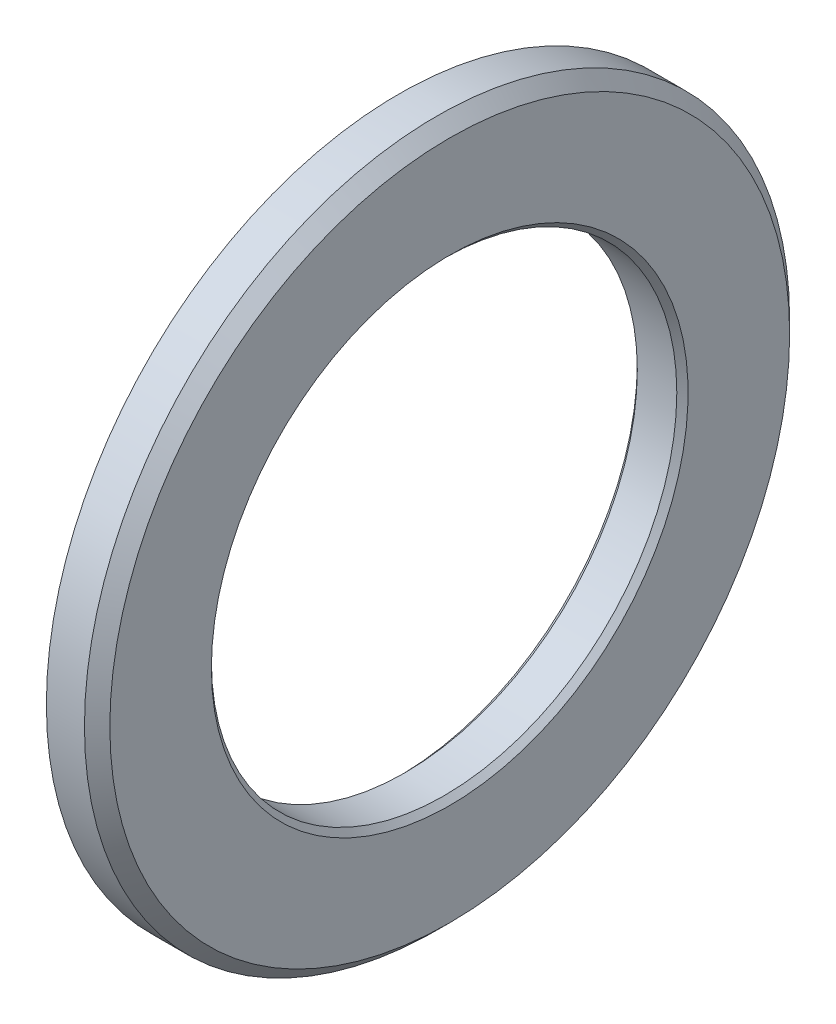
from build123d import *

# Parameters (mm, degrees)
SKETCH1_W         = 18
SKETCH1_H         = 42.5
IDCHAMFER_SIZE    = 2
ODCHAMFER_SIZE    = 4.5
IDCHAMFERFAR_SIZE = 2


with BuildPart() as part:
    # Sketch1 → Base-Revolve (revolve)
    with BuildSketch(Plane.XY, mode=Mode.PRIVATE) as base_revolve_sk:
        with Locations((-9, 103.75)):
            Rectangle(SKETCH1_W, SKETCH1_H)
    revolve(base_revolve_sk.sketch.rotate(Axis((-34.925, 0, 0), (1, 0, 0)), 90), axis=Axis((-34.925, 0, 0), (1, 0, 0)))

    # IDChamfer
    idchamfer_edges = [part.edges().sort_by_distance(p)[0] for p in [
        (0, 0, -82.5),
    ]]
    chamfer(idchamfer_edges, length=IDCHAMFER_SIZE)

    # ODChamfer
    odchamfer_edges = [part.edges().sort_by_distance(p)[0] for p in [
        (0, 0, -125),
    ]]
    chamfer(odchamfer_edges, length=ODCHAMFER_SIZE)

    # IDChamferFar
    idchamferfar_edges = [part.edges().sort_by_distance(p)[0] for p in [
        (-18, 0, -82.5),
    ]]
    chamfer(idchamferfar_edges, length=IDCHAMFERFAR_SIZE)


solid = part.part
